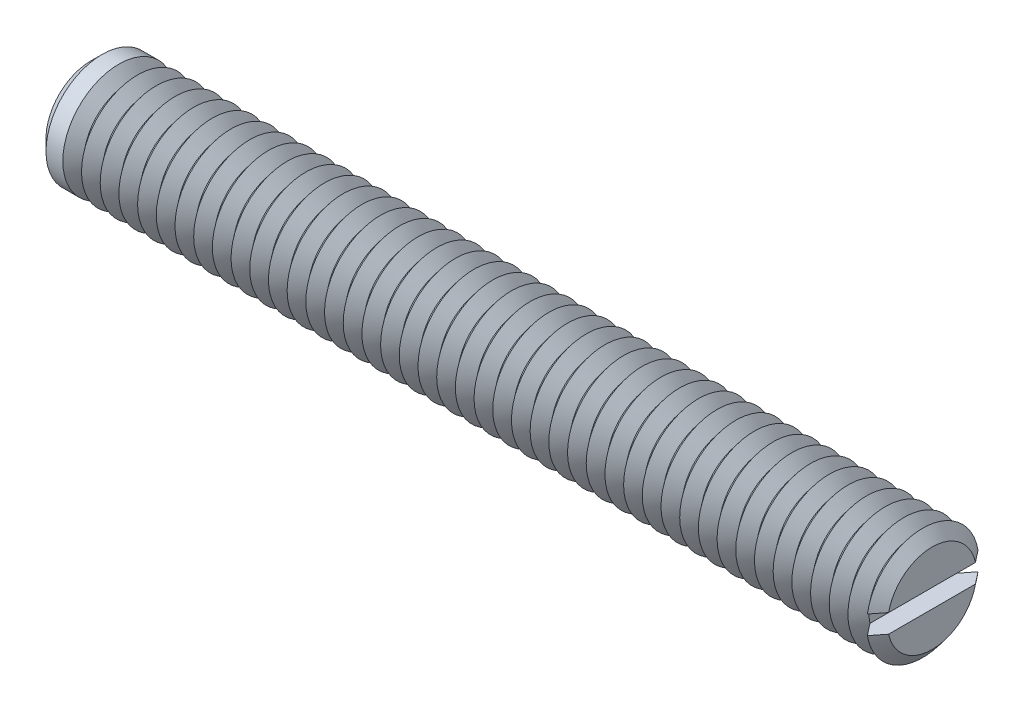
from build123d import *

# Parameters (mm, degrees)
SKETCH1_R       = 3
EXTRUDE1_DEPTH  = 22.5
SKETCH2_W       = 1
SKETCH2_H       = 1
EXTRUDE2_DEPTH  = 4.5
CHAMFER1_SIZE   = 0.6
LPATTERN1_COUNT = 44
LPATTERN1_PITCH = 1


with BuildPart() as part:
    # Sketch1 → Extrude1 (new, symmetric)
    with BuildSketch(Plane(origin=(0, 0, 0), x_dir=(0, 0, -1), z_dir=(1, 0, 0))):
        with Locations(Location((0, 0, 0), (0, 0, 180))):
            Circle(SKETCH1_R)
    extrude(amount=EXTRUDE1_DEPTH, both=True)

    # Sketch2 → Extrude2 (cut, symmetric)
    with BuildSketch(Plane.XY):
        with Locations((22, 0)):
            Rectangle(SKETCH2_W, SKETCH2_H)
    extrude(amount=EXTRUDE2_DEPTH, both=True, mode=Mode.SUBTRACT)

    # Chamfer1
    chamfer1_edges = [part.edges().sort_by_distance(p)[0] for p in [
        (-22.5, 0, -3),
    ]]
    chamfer(chamfer1_edges, length=CHAMFER1_SIZE)

    # Sketch3 → Cut-Revolve1 (revolve, cut)
    with BuildSketch(Plane.XY, mode=Mode.PRIVATE) as cut_revolve1_sk:
        Polygon((22, -3), (23, -3), (22.5, -2.3755002), align=None)
    cut_revolve1 = revolve(cut_revolve1_sk.sketch.rotate(Axis((0, 0, 0), (1, 0, 0)), 260.405931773), axis=Axis((0, 0, 0), (1, 0, 0)), mode=Mode.SUBTRACT)

    # LPattern1: Cut-Revolve1 ×44
    with Locations(*[(-i * LPATTERN1_PITCH, 0, 0) for i in range(1, LPATTERN1_COUNT)]):
        add(cut_revolve1, mode=Mode.SUBTRACT)


solid = part.part
